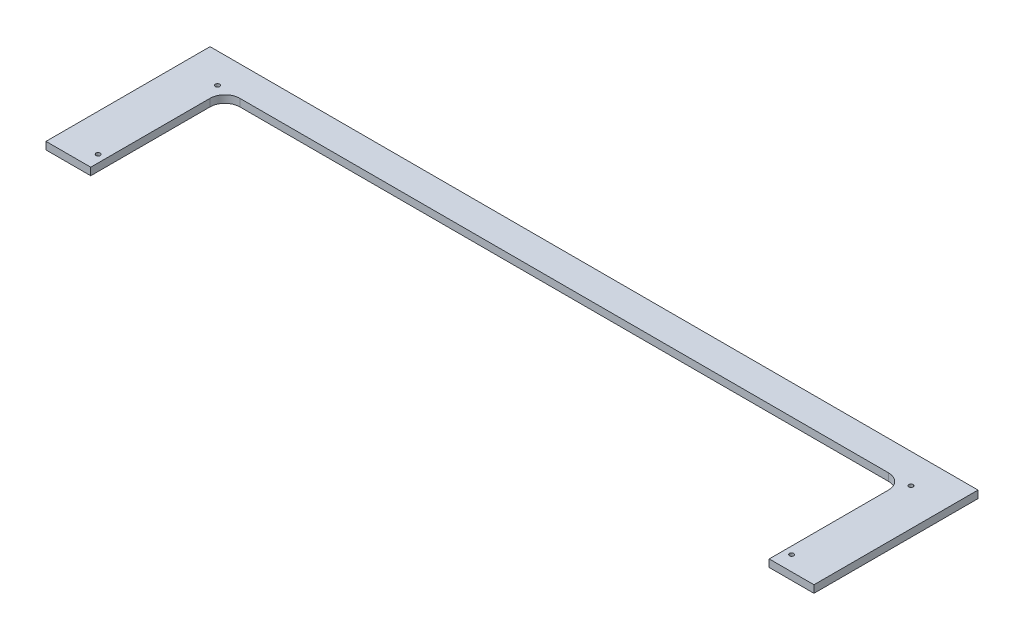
ISO-10303-21;
HEADER;
FILE_DESCRIPTION(('STEP AP214'),'2;1');
FILE_NAME('part.step','',(''),(''),'','','');
FILE_SCHEMA(('AUTOMOTIVE_DESIGN { 1 0 10303 214 1 1 1 1 }'));
ENDSEC;
DATA;
#1=APPLICATION_CONTEXT('core data for automotive mechanical design processes');
#2=APPLICATION_PROTOCOL_DEFINITION('international standard','automotive_design',2000,#1);
#3=PRODUCT_CONTEXT('',#1,'mechanical');
#4=PRODUCT('Part','Part','',(#3));
#5=PRODUCT_RELATED_PRODUCT_CATEGORY('part','',(#4));
#6=PRODUCT_DEFINITION_FORMATION('','',#4);
#7=PRODUCT_DEFINITION_CONTEXT('part definition',#1,'design');
#8=PRODUCT_DEFINITION('design','',#6,#7);
#9=PRODUCT_DEFINITION_SHAPE('','',#8);
#10=(LENGTH_UNIT() NAMED_UNIT(*) SI_UNIT(.MILLI.,.METRE.));
#11=(NAMED_UNIT(*) PLANE_ANGLE_UNIT() SI_UNIT($,.RADIAN.));
#12=(NAMED_UNIT(*) SI_UNIT($,.STERADIAN.) SOLID_ANGLE_UNIT());
#13=UNCERTAINTY_MEASURE_WITH_UNIT(LENGTH_MEASURE(1.E-05),#10,'distance_accuracy_value','');
#14=(GEOMETRIC_REPRESENTATION_CONTEXT(3) GLOBAL_UNCERTAINTY_ASSIGNED_CONTEXT((#13)) GLOBAL_UNIT_ASSIGNED_CONTEXT((#10,
#11,#12)) REPRESENTATION_CONTEXT('',''));
#15=CARTESIAN_POINT('',(0.,0.,0.));
#16=DIRECTION('',(0.,0.,1.));
#17=DIRECTION('',(1.,0.,0.));
#18=AXIS2_PLACEMENT_3D('',#15,#16,#17);
#19=CARTESIAN_POINT('',(-327.025,6.35,69.85));
#20=DIRECTION('',(0.,0.,-1.));
#21=DIRECTION('',(-1.,0.,0.));
#22=AXIS2_PLACEMENT_3D('',#19,#20,#21);
#23=PLANE('',#22);
#24=DIRECTION('',(1.,0.,0.));
#25=VECTOR('',#24,1.);
#26=CARTESIAN_POINT('',(-327.025,0.,69.85));
#27=LINE('',#26,#25);
#28=CARTESIAN_POINT('',(-327.025,0.,69.85));
#29=VERTEX_POINT('',#28);
#30=CARTESIAN_POINT('',(-288.925,0.,69.85));
#31=VERTEX_POINT('',#30);
#32=EDGE_CURVE('E254',#29,#31,#27,.T.);
#33=ORIENTED_EDGE('',*,*,#32,.T.);
#34=DIRECTION('',(0.,1.,0.));
#35=VECTOR('',#34,1.);
#36=CARTESIAN_POINT('',(-288.925,0.,69.85));
#37=LINE('',#36,#35);
#38=CARTESIAN_POINT('',(-288.925,6.35,69.85));
#39=VERTEX_POINT('',#38);
#40=EDGE_CURVE('E231',#31,#39,#37,.T.);
#41=ORIENTED_EDGE('',*,*,#40,.T.);
#42=DIRECTION('',(1.,0.,0.));
#43=VECTOR('',#42,1.);
#44=CARTESIAN_POINT('',(-327.025,6.35,69.85));
#45=LINE('',#44,#43);
#46=CARTESIAN_POINT('',(-327.025,6.35,69.85));
#47=VERTEX_POINT('',#46);
#48=EDGE_CURVE('E89',#47,#39,#45,.T.);
#49=ORIENTED_EDGE('',*,*,#48,.F.);
#50=DIRECTION('',(0.,-1.,0.));
#51=VECTOR('',#50,1.);
#52=CARTESIAN_POINT('',(-327.025,6.35,69.85));
#53=LINE('',#52,#51);
#54=EDGE_CURVE('E11',#47,#29,#53,.T.);
#55=ORIENTED_EDGE('',*,*,#54,.T.);
#56=EDGE_LOOP('',(#33,#41,#49,#55));
#57=FACE_BOUND('',#56,.T.);
#58=ADVANCED_FACE('F37',(#57),#23,.F.);
#59=CARTESIAN_POINT('',(-327.025,6.35,-69.85));
#60=DIRECTION('',(1.,0.,0.));
#61=DIRECTION('',(0.,0.,-1.));
#62=AXIS2_PLACEMENT_3D('',#59,#60,#61);
#63=PLANE('',#62);
#64=DIRECTION('',(0.,0.,1.));
#65=VECTOR('',#64,1.);
#66=CARTESIAN_POINT('',(-327.025,0.,-69.85));
#67=LINE('',#66,#65);
#68=CARTESIAN_POINT('',(-327.025,0.,-69.85));
#69=VERTEX_POINT('',#68);
#70=EDGE_CURVE('E233',#69,#29,#67,.T.);
#71=ORIENTED_EDGE('',*,*,#70,.T.);
#72=ORIENTED_EDGE('',*,*,#54,.F.);
#73=DIRECTION('',(0.,0.,1.));
#74=VECTOR('',#73,1.);
#75=CARTESIAN_POINT('',(-327.025,6.35,-69.85));
#76=LINE('',#75,#74);
#77=CARTESIAN_POINT('',(-327.025,6.35,-69.85));
#78=VERTEX_POINT('',#77);
#79=EDGE_CURVE('E243',#78,#47,#76,.T.);
#80=ORIENTED_EDGE('',*,*,#79,.F.);
#81=DIRECTION('',(0.,-1.,0.));
#82=VECTOR('',#81,1.);
#83=CARTESIAN_POINT('',(-327.025,6.35,-69.85));
#84=LINE('',#83,#82);
#85=EDGE_CURVE('E250',#78,#69,#84,.T.);
#86=ORIENTED_EDGE('',*,*,#85,.T.);
#87=EDGE_LOOP('',(#71,#72,#80,#86));
#88=FACE_BOUND('',#87,.T.);
#89=ADVANCED_FACE('F39',(#88),#63,.F.);
#90=CARTESIAN_POINT('',(288.925,6.35,69.85));
#91=VERTEX_POINT('',#90);
#92=CARTESIAN_POINT('',(327.025,6.35,69.85));
#93=VERTEX_POINT('',#92);
#94=EDGE_CURVE('E245',#91,#93,#45,.T.);
#95=ORIENTED_EDGE('',*,*,#94,.F.);
#96=DIRECTION('',(0.,1.,0.));
#97=VECTOR('',#96,1.);
#98=CARTESIAN_POINT('',(288.925,0.,69.85));
#99=LINE('',#98,#97);
#100=CARTESIAN_POINT('',(288.925,0.,69.85));
#101=VERTEX_POINT('',#100);
#102=EDGE_CURVE('E218',#101,#91,#99,.T.);
#103=ORIENTED_EDGE('',*,*,#102,.F.);
#104=CARTESIAN_POINT('',(327.025,0.,69.85));
#105=VERTEX_POINT('',#104);
#106=EDGE_CURVE('E253',#101,#105,#27,.T.);
#107=ORIENTED_EDGE('',*,*,#106,.T.);
#108=DIRECTION('',(0.,-1.,0.));
#109=VECTOR('',#108,1.);
#110=CARTESIAN_POINT('',(327.025,6.35,69.85));
#111=LINE('',#110,#109);
#112=EDGE_CURVE('E45',#93,#105,#111,.T.);
#113=ORIENTED_EDGE('',*,*,#112,.F.);
#114=EDGE_LOOP('',(#95,#103,#107,#113));
#115=FACE_BOUND('',#114,.T.);
#116=ADVANCED_FACE('F289',(#115),#23,.F.);
#117=CARTESIAN_POINT('',(327.025,6.35,-69.85));
#118=DIRECTION('',(-1.,0.,0.));
#119=DIRECTION('',(0.,0.,1.));
#120=AXIS2_PLACEMENT_3D('',#117,#118,#119);
#121=PLANE('',#120);
#122=DIRECTION('',(0.,0.,-1.));
#123=VECTOR('',#122,1.);
#124=CARTESIAN_POINT('',(327.025,0.,-69.85));
#125=LINE('',#124,#123);
#126=CARTESIAN_POINT('',(327.025,0.,-69.85));
#127=VERTEX_POINT('',#126);
#128=EDGE_CURVE('E257',#105,#127,#125,.T.);
#129=ORIENTED_EDGE('',*,*,#128,.T.);
#130=DIRECTION('',(0.,-1.,0.));
#131=VECTOR('',#130,1.);
#132=CARTESIAN_POINT('',(327.025,6.35,-69.85));
#133=LINE('',#132,#131);
#134=CARTESIAN_POINT('',(327.025,6.35,-69.85));
#135=VERTEX_POINT('',#134);
#136=EDGE_CURVE('E261',#135,#127,#133,.T.);
#137=ORIENTED_EDGE('',*,*,#136,.F.);
#138=DIRECTION('',(0.,0.,-1.));
#139=VECTOR('',#138,1.);
#140=CARTESIAN_POINT('',(327.025,6.35,-69.85));
#141=LINE('',#140,#139);
#142=EDGE_CURVE('E247',#93,#135,#141,.T.);
#143=ORIENTED_EDGE('',*,*,#142,.F.);
#144=ORIENTED_EDGE('',*,*,#112,.T.);
#145=EDGE_LOOP('',(#129,#137,#143,#144));
#146=FACE_BOUND('',#145,.T.);
#147=ADVANCED_FACE('F267',(#146),#121,.F.);
#148=CARTESIAN_POINT('',(-327.025,6.35,-69.85));
#149=DIRECTION('',(0.,0.,1.));
#150=DIRECTION('',(1.,0.,0.));
#151=AXIS2_PLACEMENT_3D('',#148,#149,#150);
#152=PLANE('',#151);
#153=CARTESIAN_POINT('',(295.275,3.17500000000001,-69.85));
#154=DIRECTION('',(0.,0.,-1.));
#155=DIRECTION('',(-1.,0.,0.));
#156=AXIS2_PLACEMENT_3D('',#153,#154,#155);
#157=CIRCLE('',#156,1.35255000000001);
#158=CARTESIAN_POINT('',(293.92245,3.17500000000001,-69.85));
#159=VERTEX_POINT('',#158);
#160=EDGE_CURVE('E145',#159,#159,#157,.T.);
#161=ORIENTED_EDGE('',*,*,#160,.F.);
#162=EDGE_LOOP('',(#161));
#163=FACE_BOUND('',#162,.T.);
#164=CARTESIAN_POINT('',(98.425,3.17500000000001,-69.85));
#165=DIRECTION('',(0.,0.,-1.));
#166=DIRECTION('',(-1.,0.,0.));
#167=AXIS2_PLACEMENT_3D('',#164,#165,#166);
#168=CIRCLE('',#167,1.35254999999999);
#169=CARTESIAN_POINT('',(97.07245,3.17500000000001,-69.85));
#170=VERTEX_POINT('',#169);
#171=EDGE_CURVE('E144',#170,#170,#168,.T.);
#172=ORIENTED_EDGE('',*,*,#171,.F.);
#173=EDGE_LOOP('',(#172));
#174=FACE_BOUND('',#173,.T.);
#175=CARTESIAN_POINT('',(-98.425,3.17500000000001,-69.85));
#176=DIRECTION('',(0.,0.,-1.));
#177=DIRECTION('',(-1.,0.,0.));
#178=AXIS2_PLACEMENT_3D('',#175,#176,#177);
#179=CIRCLE('',#178,1.35254999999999);
#180=CARTESIAN_POINT('',(-99.77755,3.17500000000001,-69.85));
#181=VERTEX_POINT('',#180);
#182=EDGE_CURVE('E155',#181,#181,#179,.T.);
#183=ORIENTED_EDGE('',*,*,#182,.F.);
#184=EDGE_LOOP('',(#183));
#185=FACE_BOUND('',#184,.T.);
#186=CARTESIAN_POINT('',(-295.275,3.17500000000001,-69.85));
#187=DIRECTION('',(0.,0.,-1.));
#188=DIRECTION('',(-1.,0.,0.));
#189=AXIS2_PLACEMENT_3D('',#186,#187,#188);
#190=CIRCLE('',#189,1.35255000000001);
#191=CARTESIAN_POINT('',(-296.62755,3.17500000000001,-69.85));
#192=VERTEX_POINT('',#191);
#193=EDGE_CURVE('E161',#192,#192,#190,.T.);
#194=ORIENTED_EDGE('',*,*,#193,.F.);
#195=EDGE_LOOP('',(#194));
#196=FACE_BOUND('',#195,.T.);
#197=DIRECTION('',(-1.,0.,0.));
#198=VECTOR('',#197,1.);
#199=CARTESIAN_POINT('',(-327.025,0.,-69.85));
#200=LINE('',#199,#198);
#201=EDGE_CURVE('E82',#127,#69,#200,.T.);
#202=ORIENTED_EDGE('',*,*,#201,.T.);
#203=ORIENTED_EDGE('',*,*,#85,.F.);
#204=DIRECTION('',(-1.,0.,0.));
#205=VECTOR('',#204,1.);
#206=CARTESIAN_POINT('',(-327.025,6.35,-69.85));
#207=LINE('',#206,#205);
#208=EDGE_CURVE('E61',#135,#78,#207,.T.);
#209=ORIENTED_EDGE('',*,*,#208,.F.);
#210=ORIENTED_EDGE('',*,*,#136,.T.);
#211=EDGE_LOOP('',(#202,#203,#209,#210));
#212=FACE_BOUND('',#211,.T.);
#213=ADVANCED_FACE('F278',(#163,#174,#185,#196,#212),#152,.F.);
#214=CARTESIAN_POINT('',(0.,6.35,0.));
#215=DIRECTION('',(0.,1.,0.));
#216=DIRECTION('',(0.,0.,1.));
#217=AXIS2_PLACEMENT_3D('',#214,#215,#216);
#218=PLANE('',#217);
#219=CARTESIAN_POINT('',(-295.275,6.35,57.15));
#220=DIRECTION('',(0.,-1.,0.));
#221=DIRECTION('',(0.,0.,-1.));
#222=AXIS2_PLACEMENT_3D('',#219,#220,#221);
#223=CIRCLE('',#222,1.82880000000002);
#224=CARTESIAN_POINT('',(-295.275,6.35,55.3212));
#225=VERTEX_POINT('',#224);
#226=EDGE_CURVE('E173',#225,#225,#223,.T.);
#227=ORIENTED_EDGE('',*,*,#226,.T.);
#228=EDGE_LOOP('',(#227));
#229=FACE_BOUND('',#228,.T.);
#230=CARTESIAN_POINT('',(-295.275,6.35,-44.45));
#231=DIRECTION('',(0.,-1.,0.));
#232=DIRECTION('',(0.,0.,-1.));
#233=AXIS2_PLACEMENT_3D('',#230,#231,#232);
#234=CIRCLE('',#233,1.82880000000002);
#235=CARTESIAN_POINT('',(-295.275,6.35,-46.2788));
#236=VERTEX_POINT('',#235);
#237=EDGE_CURVE('E182',#236,#236,#234,.T.);
#238=ORIENTED_EDGE('',*,*,#237,.T.);
#239=EDGE_LOOP('',(#238));
#240=FACE_BOUND('',#239,.T.);
#241=CARTESIAN_POINT('',(295.275,6.35,-44.4499999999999));
#242=DIRECTION('',(0.,-1.,0.));
#243=DIRECTION('',(0.,0.,-1.));
#244=AXIS2_PLACEMENT_3D('',#241,#242,#243);
#245=CIRCLE('',#244,1.82880000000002);
#246=CARTESIAN_POINT('',(295.275,6.35,-46.2787999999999));
#247=VERTEX_POINT('',#246);
#248=EDGE_CURVE('E191',#247,#247,#245,.T.);
#249=ORIENTED_EDGE('',*,*,#248,.T.);
#250=EDGE_LOOP('',(#249));
#251=FACE_BOUND('',#250,.T.);
#252=CARTESIAN_POINT('',(295.275,6.35,57.1500000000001));
#253=DIRECTION('',(0.,-1.,0.));
#254=DIRECTION('',(0.,0.,-1.));
#255=AXIS2_PLACEMENT_3D('',#252,#253,#254);
#256=CIRCLE('',#255,1.82880000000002);
#257=CARTESIAN_POINT('',(295.275,6.35,55.3212000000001));
#258=VERTEX_POINT('',#257);
#259=EDGE_CURVE('E200',#258,#258,#256,.T.);
#260=ORIENTED_EDGE('',*,*,#259,.T.);
#261=EDGE_LOOP('',(#260));
#262=FACE_BOUND('',#261,.T.);
#263=DIRECTION('',(0.,0.,1.));
#264=VECTOR('',#263,1.);
#265=CARTESIAN_POINT('',(-288.925,6.35,69.85));
#266=LINE('',#265,#264);
#267=CARTESIAN_POINT('',(-288.925,6.35,-31.75));
#268=VERTEX_POINT('',#267);
#269=EDGE_CURVE('E207',#268,#39,#266,.T.);
#270=ORIENTED_EDGE('',*,*,#269,.F.);
#271=CARTESIAN_POINT('',(-276.225,6.35,-31.75));
#272=DIRECTION('',(0.,1.,0.));
#273=DIRECTION('',(0.,0.,1.));
#274=AXIS2_PLACEMENT_3D('',#271,#272,#273);
#275=CIRCLE('',#274,12.7);
#276=CARTESIAN_POINT('',(-276.225,6.35,-44.45));
#277=VERTEX_POINT('',#276);
#278=EDGE_CURVE('E227',#277,#268,#275,.T.);
#279=ORIENTED_EDGE('',*,*,#278,.F.);
#280=DIRECTION('',(-1.,0.,0.));
#281=VECTOR('',#280,1.);
#282=CARTESIAN_POINT('',(-276.225,6.35,-44.45));
#283=LINE('',#282,#281);
#284=CARTESIAN_POINT('',(276.225,6.35,-44.45));
#285=VERTEX_POINT('',#284);
#286=EDGE_CURVE('E224',#285,#277,#283,.T.);
#287=ORIENTED_EDGE('',*,*,#286,.F.);
#288=CARTESIAN_POINT('',(276.225,6.35,-31.75));
#289=DIRECTION('',(0.,1.,0.));
#290=DIRECTION('',(0.,0.,1.));
#291=AXIS2_PLACEMENT_3D('',#288,#289,#290);
#292=CIRCLE('',#291,12.7);
#293=CARTESIAN_POINT('',(288.925,6.35,-31.75));
#294=VERTEX_POINT('',#293);
#295=EDGE_CURVE('E221',#294,#285,#292,.T.);
#296=ORIENTED_EDGE('',*,*,#295,.F.);
#297=DIRECTION('',(0.,0.,-1.));
#298=VECTOR('',#297,1.);
#299=CARTESIAN_POINT('',(288.925,6.35,-31.75));
#300=LINE('',#299,#298);
#301=EDGE_CURVE('E203',#91,#294,#300,.T.);
#302=ORIENTED_EDGE('',*,*,#301,.F.);
#303=ORIENTED_EDGE('',*,*,#94,.T.);
#304=ORIENTED_EDGE('',*,*,#142,.T.);
#305=ORIENTED_EDGE('',*,*,#208,.T.);
#306=ORIENTED_EDGE('',*,*,#79,.T.);
#307=ORIENTED_EDGE('',*,*,#48,.T.);
#308=EDGE_LOOP('',(#270,#279,#287,#296,#302,#303,#304,#305,#306,#307));
#309=FACE_BOUND('',#308,.T.);
#310=ADVANCED_FACE('F280',(#229,#240,#251,#262,#309),#218,.T.);
#311=CARTESIAN_POINT('',(0.,0.,0.));
#312=DIRECTION('',(0.,1.,0.));
#313=DIRECTION('',(0.,0.,1.));
#314=AXIS2_PLACEMENT_3D('',#311,#312,#313);
#315=PLANE('',#314);
#316=CARTESIAN_POINT('',(-295.275,0.,57.15));
#317=DIRECTION('',(0.,-1.,0.));
#318=DIRECTION('',(0.,0.,-1.));
#319=AXIS2_PLACEMENT_3D('',#316,#317,#318);
#320=CIRCLE('',#319,3.89889999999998);
#321=CARTESIAN_POINT('',(-295.275,0.,53.2511000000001));
#322=VERTEX_POINT('',#321);
#323=EDGE_CURVE('E167',#322,#322,#320,.T.);
#324=ORIENTED_EDGE('',*,*,#323,.F.);
#325=EDGE_LOOP('',(#324));
#326=FACE_BOUND('',#325,.T.);
#327=CARTESIAN_POINT('',(-295.275,0.,-44.45));
#328=DIRECTION('',(0.,-1.,0.));
#329=DIRECTION('',(0.,0.,-1.));
#330=AXIS2_PLACEMENT_3D('',#327,#328,#329);
#331=CIRCLE('',#330,3.89889999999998);
#332=CARTESIAN_POINT('',(-295.275,0.,-48.3488999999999));
#333=VERTEX_POINT('',#332);
#334=EDGE_CURVE('E176',#333,#333,#331,.T.);
#335=ORIENTED_EDGE('',*,*,#334,.F.);
#336=EDGE_LOOP('',(#335));
#337=FACE_BOUND('',#336,.T.);
#338=CARTESIAN_POINT('',(295.275,0.,-44.4499999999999));
#339=DIRECTION('',(0.,-1.,0.));
#340=DIRECTION('',(0.,0.,-1.));
#341=AXIS2_PLACEMENT_3D('',#338,#339,#340);
#342=CIRCLE('',#341,3.89889999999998);
#343=CARTESIAN_POINT('',(295.275,0.,-48.3488999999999));
#344=VERTEX_POINT('',#343);
#345=EDGE_CURVE('E185',#344,#344,#342,.T.);
#346=ORIENTED_EDGE('',*,*,#345,.F.);
#347=EDGE_LOOP('',(#346));
#348=FACE_BOUND('',#347,.T.);
#349=CARTESIAN_POINT('',(295.275,0.,57.1500000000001));
#350=DIRECTION('',(0.,-1.,0.));
#351=DIRECTION('',(0.,0.,-1.));
#352=AXIS2_PLACEMENT_3D('',#349,#350,#351);
#353=CIRCLE('',#352,3.89889999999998);
#354=CARTESIAN_POINT('',(295.275,0.,53.2511000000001));
#355=VERTEX_POINT('',#354);
#356=EDGE_CURVE('E194',#355,#355,#353,.T.);
#357=ORIENTED_EDGE('',*,*,#356,.F.);
#358=EDGE_LOOP('',(#357));
#359=FACE_BOUND('',#358,.T.);
#360=CARTESIAN_POINT('',(-276.225,0.,-31.75));
#361=DIRECTION('',(0.,1.,0.));
#362=DIRECTION('',(0.,0.,1.));
#363=AXIS2_PLACEMENT_3D('',#360,#361,#362);
#364=CIRCLE('',#363,12.7);
#365=CARTESIAN_POINT('',(-276.225,0.,-44.45));
#366=VERTEX_POINT('',#365);
#367=CARTESIAN_POINT('',(-288.925,0.,-31.75));
#368=VERTEX_POINT('',#367);
#369=EDGE_CURVE('E212',#366,#368,#364,.T.);
#370=ORIENTED_EDGE('',*,*,#369,.T.);
#371=DIRECTION('',(0.,0.,1.));
#372=VECTOR('',#371,1.);
#373=CARTESIAN_POINT('',(-288.925,0.,69.85));
#374=LINE('',#373,#372);
#375=EDGE_CURVE('E215',#368,#31,#374,.T.);
#376=ORIENTED_EDGE('',*,*,#375,.T.);
#377=ORIENTED_EDGE('',*,*,#32,.F.);
#378=ORIENTED_EDGE('',*,*,#70,.F.);
#379=ORIENTED_EDGE('',*,*,#201,.F.);
#380=ORIENTED_EDGE('',*,*,#128,.F.);
#381=ORIENTED_EDGE('',*,*,#106,.F.);
#382=DIRECTION('',(0.,0.,-1.));
#383=VECTOR('',#382,1.);
#384=CARTESIAN_POINT('',(288.925,0.,-31.75));
#385=LINE('',#384,#383);
#386=CARTESIAN_POINT('',(288.925,0.,-31.75));
#387=VERTEX_POINT('',#386);
#388=EDGE_CURVE('E204',#101,#387,#385,.T.);
#389=ORIENTED_EDGE('',*,*,#388,.T.);
#390=CARTESIAN_POINT('',(276.225,0.,-31.75));
#391=DIRECTION('',(0.,1.,0.));
#392=DIRECTION('',(0.,0.,1.));
#393=AXIS2_PLACEMENT_3D('',#390,#391,#392);
#394=CIRCLE('',#393,12.7);
#395=CARTESIAN_POINT('',(276.225,0.,-44.45));
#396=VERTEX_POINT('',#395);
#397=EDGE_CURVE('E52',#387,#396,#394,.T.);
#398=ORIENTED_EDGE('',*,*,#397,.T.);
#399=DIRECTION('',(-1.,0.,0.));
#400=VECTOR('',#399,1.);
#401=CARTESIAN_POINT('',(-276.225,0.,-44.45));
#402=LINE('',#401,#400);
#403=EDGE_CURVE('E209',#396,#366,#402,.T.);
#404=ORIENTED_EDGE('',*,*,#403,.T.);
#405=EDGE_LOOP('',(#370,#376,#377,#378,#379,#380,#381,#389,#398,#404));
#406=FACE_BOUND('',#405,.T.);
#407=ADVANCED_FACE('F273',(#326,#337,#348,#359,#406),#315,.F.);
#408=CARTESIAN_POINT('',(-288.925,0.,69.85));
#409=DIRECTION('',(-1.,0.,0.));
#410=DIRECTION('',(0.,0.,1.));
#411=AXIS2_PLACEMENT_3D('',#408,#409,#410);
#412=PLANE('',#411);
#413=ORIENTED_EDGE('',*,*,#269,.T.);
#414=ORIENTED_EDGE('',*,*,#40,.F.);
#415=ORIENTED_EDGE('',*,*,#375,.F.);
#416=DIRECTION('',(0.,1.,0.));
#417=VECTOR('',#416,1.);
#418=CARTESIAN_POINT('',(-288.925,0.,-31.75));
#419=LINE('',#418,#417);
#420=EDGE_CURVE('E234',#368,#268,#419,.T.);
#421=ORIENTED_EDGE('',*,*,#420,.T.);
#422=EDGE_LOOP('',(#413,#414,#415,#421));
#423=FACE_BOUND('',#422,.T.);
#424=ADVANCED_FACE('F317',(#423),#412,.F.);
#425=CARTESIAN_POINT('',(-276.225,0.,-31.75));
#426=DIRECTION('',(0.,1.,0.));
#427=DIRECTION('',(0.,0.,1.));
#428=AXIS2_PLACEMENT_3D('',#425,#426,#427);
#429=CYLINDRICAL_SURFACE('',#428,12.7);
#430=ORIENTED_EDGE('',*,*,#278,.T.);
#431=ORIENTED_EDGE('',*,*,#420,.F.);
#432=ORIENTED_EDGE('',*,*,#369,.F.);
#433=DIRECTION('',(0.,1.,0.));
#434=VECTOR('',#433,1.);
#435=CARTESIAN_POINT('',(-276.225,0.,-44.45));
#436=LINE('',#435,#434);
#437=EDGE_CURVE('E236',#366,#277,#436,.T.);
#438=ORIENTED_EDGE('',*,*,#437,.T.);
#439=EDGE_LOOP('',(#430,#431,#432,#438));
#440=FACE_BOUND('',#439,.T.);
#441=ADVANCED_FACE('F314',(#440),#429,.F.);
#442=CARTESIAN_POINT('',(-276.225,0.,-44.45));
#443=DIRECTION('',(0.,0.,-1.));
#444=DIRECTION('',(-1.,0.,0.));
#445=AXIS2_PLACEMENT_3D('',#442,#443,#444);
#446=PLANE('',#445);
#447=ORIENTED_EDGE('',*,*,#286,.T.);
#448=ORIENTED_EDGE('',*,*,#437,.F.);
#449=ORIENTED_EDGE('',*,*,#403,.F.);
#450=DIRECTION('',(0.,1.,0.));
#451=VECTOR('',#450,1.);
#452=CARTESIAN_POINT('',(276.225,0.,-44.45));
#453=LINE('',#452,#451);
#454=EDGE_CURVE('E238',#396,#285,#453,.T.);
#455=ORIENTED_EDGE('',*,*,#454,.T.);
#456=EDGE_LOOP('',(#447,#448,#449,#455));
#457=FACE_BOUND('',#456,.T.);
#458=ADVANCED_FACE('F311',(#457),#446,.F.);
#459=CARTESIAN_POINT('',(276.225,0.,-31.75));
#460=DIRECTION('',(0.,1.,0.));
#461=DIRECTION('',(0.,0.,1.));
#462=AXIS2_PLACEMENT_3D('',#459,#460,#461);
#463=CYLINDRICAL_SURFACE('',#462,12.7);
#464=ORIENTED_EDGE('',*,*,#295,.T.);
#465=ORIENTED_EDGE('',*,*,#454,.F.);
#466=ORIENTED_EDGE('',*,*,#397,.F.);
#467=DIRECTION('',(0.,1.,0.));
#468=VECTOR('',#467,1.);
#469=CARTESIAN_POINT('',(288.925,0.,-31.75));
#470=LINE('',#469,#468);
#471=EDGE_CURVE('E240',#387,#294,#470,.T.);
#472=ORIENTED_EDGE('',*,*,#471,.T.);
#473=EDGE_LOOP('',(#464,#465,#466,#472));
#474=FACE_BOUND('',#473,.T.);
#475=ADVANCED_FACE('F332',(#474),#463,.F.);
#476=CARTESIAN_POINT('',(288.925,0.,-31.75));
#477=DIRECTION('',(1.,0.,0.));
#478=DIRECTION('',(0.,0.,-1.));
#479=AXIS2_PLACEMENT_3D('',#476,#477,#478);
#480=PLANE('',#479);
#481=ORIENTED_EDGE('',*,*,#301,.T.);
#482=ORIENTED_EDGE('',*,*,#471,.F.);
#483=ORIENTED_EDGE('',*,*,#388,.F.);
#484=ORIENTED_EDGE('',*,*,#102,.T.);
#485=EDGE_LOOP('',(#481,#482,#483,#484));
#486=FACE_BOUND('',#485,.T.);
#487=ADVANCED_FACE('F307',(#486),#480,.F.);
#488=CARTESIAN_POINT('',(295.275,0.,57.1500000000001));
#489=DIRECTION('',(0.,-1.,0.));
#490=DIRECTION('',(0.,0.,-1.));
#491=AXIS2_PLACEMENT_3D('',#488,#489,#490);
#492=CYLINDRICAL_SURFACE('',#491,1.82880000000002);
#493=ORIENTED_EDGE('',*,*,#259,.F.);
#494=EDGE_LOOP('',(#493));
#495=FACE_BOUND('',#494,.T.);
#496=CARTESIAN_POINT('',(295.275,2.38137763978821,57.1500000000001));
#497=DIRECTION('',(0.,-1.,0.));
#498=DIRECTION('',(0.,0.,-1.));
#499=AXIS2_PLACEMENT_3D('',#496,#497,#498);
#500=CIRCLE('',#499,1.82880000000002);
#501=CARTESIAN_POINT('',(295.275,2.38137763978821,55.3212000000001));
#502=VERTEX_POINT('',#501);
#503=EDGE_CURVE('E197',#502,#502,#500,.T.);
#504=ORIENTED_EDGE('',*,*,#503,.T.);
#505=EDGE_LOOP('',(#504));
#506=FACE_BOUND('',#505,.T.);
#507=ADVANCED_FACE('F327',(#495,#506),#492,.F.);
#508=CARTESIAN_POINT('',(295.275,0.,57.1500000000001));
#509=DIRECTION('',(0.,-1.,0.));
#510=DIRECTION('',(0.,0.,-1.));
#511=AXIS2_PLACEMENT_3D('',#508,#509,#510);
#512=CONICAL_SURFACE('',#511,3.89889999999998,0.715584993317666);
#513=ORIENTED_EDGE('',*,*,#503,.F.);
#514=EDGE_LOOP('',(#513));
#515=FACE_BOUND('',#514,.T.);
#516=ORIENTED_EDGE('',*,*,#356,.T.);
#517=EDGE_LOOP('',(#516));
#518=FACE_BOUND('',#517,.T.);
#519=ADVANCED_FACE('F339',(#515,#518),#512,.F.);
#520=CARTESIAN_POINT('',(295.275,0.,-44.4499999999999));
#521=DIRECTION('',(0.,-1.,0.));
#522=DIRECTION('',(0.,0.,-1.));
#523=AXIS2_PLACEMENT_3D('',#520,#521,#522);
#524=CYLINDRICAL_SURFACE('',#523,1.82880000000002);
#525=ORIENTED_EDGE('',*,*,#248,.F.);
#526=EDGE_LOOP('',(#525));
#527=FACE_BOUND('',#526,.T.);
#528=CARTESIAN_POINT('',(295.275,2.38137763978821,-44.4499999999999));
#529=DIRECTION('',(0.,-1.,0.));
#530=DIRECTION('',(0.,0.,-1.));
#531=AXIS2_PLACEMENT_3D('',#528,#529,#530);
#532=CIRCLE('',#531,1.82880000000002);
#533=CARTESIAN_POINT('',(295.275,2.38137763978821,-46.2787999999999));
#534=VERTEX_POINT('',#533);
#535=EDGE_CURVE('E188',#534,#534,#532,.T.);
#536=ORIENTED_EDGE('',*,*,#535,.T.);
#537=EDGE_LOOP('',(#536));
#538=FACE_BOUND('',#537,.T.);
#539=ADVANCED_FACE('F344',(#527,#538),#524,.F.);
#540=CARTESIAN_POINT('',(295.275,0.,-44.4499999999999));
#541=DIRECTION('',(0.,-1.,0.));
#542=DIRECTION('',(0.,0.,-1.));
#543=AXIS2_PLACEMENT_3D('',#540,#541,#542);
#544=CONICAL_SURFACE('',#543,3.89889999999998,0.715584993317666);
#545=ORIENTED_EDGE('',*,*,#535,.F.);
#546=EDGE_LOOP('',(#545));
#547=FACE_BOUND('',#546,.T.);
#548=ORIENTED_EDGE('',*,*,#345,.T.);
#549=EDGE_LOOP('',(#548));
#550=FACE_BOUND('',#549,.T.);
#551=ADVANCED_FACE('F356',(#547,#550),#544,.F.);
#552=CARTESIAN_POINT('',(-295.275,0.,-44.45));
#553=DIRECTION('',(0.,-1.,0.));
#554=DIRECTION('',(0.,0.,-1.));
#555=AXIS2_PLACEMENT_3D('',#552,#553,#554);
#556=CYLINDRICAL_SURFACE('',#555,1.82880000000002);
#557=ORIENTED_EDGE('',*,*,#237,.F.);
#558=EDGE_LOOP('',(#557));
#559=FACE_BOUND('',#558,.T.);
#560=CARTESIAN_POINT('',(-295.275,2.38137763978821,-44.45));
#561=DIRECTION('',(0.,-1.,0.));
#562=DIRECTION('',(0.,0.,-1.));
#563=AXIS2_PLACEMENT_3D('',#560,#561,#562);
#564=CIRCLE('',#563,1.82880000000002);
#565=CARTESIAN_POINT('',(-295.275,2.38137763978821,-46.2788));
#566=VERTEX_POINT('',#565);
#567=EDGE_CURVE('E179',#566,#566,#564,.T.);
#568=ORIENTED_EDGE('',*,*,#567,.T.);
#569=EDGE_LOOP('',(#568));
#570=FACE_BOUND('',#569,.T.);
#571=ADVANCED_FACE('F362',(#559,#570),#556,.F.);
#572=CARTESIAN_POINT('',(-295.275,0.,-44.45));
#573=DIRECTION('',(0.,-1.,0.));
#574=DIRECTION('',(0.,0.,-1.));
#575=AXIS2_PLACEMENT_3D('',#572,#573,#574);
#576=CONICAL_SURFACE('',#575,3.89889999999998,0.715584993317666);
#577=ORIENTED_EDGE('',*,*,#567,.F.);
#578=EDGE_LOOP('',(#577));
#579=FACE_BOUND('',#578,.T.);
#580=ORIENTED_EDGE('',*,*,#334,.T.);
#581=EDGE_LOOP('',(#580));
#582=FACE_BOUND('',#581,.T.);
#583=ADVANCED_FACE('F366',(#579,#582),#576,.F.);
#584=CARTESIAN_POINT('',(-295.275,0.,57.15));
#585=DIRECTION('',(0.,-1.,0.));
#586=DIRECTION('',(0.,0.,-1.));
#587=AXIS2_PLACEMENT_3D('',#584,#585,#586);
#588=CYLINDRICAL_SURFACE('',#587,1.82880000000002);
#589=ORIENTED_EDGE('',*,*,#226,.F.);
#590=EDGE_LOOP('',(#589));
#591=FACE_BOUND('',#590,.T.);
#592=CARTESIAN_POINT('',(-295.275,2.38137763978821,57.15));
#593=DIRECTION('',(0.,-1.,0.));
#594=DIRECTION('',(0.,0.,-1.));
#595=AXIS2_PLACEMENT_3D('',#592,#593,#594);
#596=CIRCLE('',#595,1.82880000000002);
#597=CARTESIAN_POINT('',(-295.275,2.38137763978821,55.3212));
#598=VERTEX_POINT('',#597);
#599=EDGE_CURVE('E170',#598,#598,#596,.T.);
#600=ORIENTED_EDGE('',*,*,#599,.T.);
#601=EDGE_LOOP('',(#600));
#602=FACE_BOUND('',#601,.T.);
#603=ADVANCED_FACE('F370',(#591,#602),#588,.F.);
#604=CARTESIAN_POINT('',(-295.275,0.,57.15));
#605=DIRECTION('',(0.,-1.,0.));
#606=DIRECTION('',(0.,0.,-1.));
#607=AXIS2_PLACEMENT_3D('',#604,#605,#606);
#608=CONICAL_SURFACE('',#607,3.89889999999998,0.715584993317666);
#609=ORIENTED_EDGE('',*,*,#599,.F.);
#610=EDGE_LOOP('',(#609));
#611=FACE_BOUND('',#610,.T.);
#612=ORIENTED_EDGE('',*,*,#323,.T.);
#613=EDGE_LOOP('',(#612));
#614=FACE_BOUND('',#613,.T.);
#615=ADVANCED_FACE('F374',(#611,#614),#608,.F.);
#616=CARTESIAN_POINT('',(-295.275,3.17500000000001,-58.8772));
#617=DIRECTION('',(0.,0.,-1.));
#618=DIRECTION('',(-1.,0.,0.));
#619=AXIS2_PLACEMENT_3D('',#616,#617,#618);
#620=CONICAL_SURFACE('',#619,1.35255000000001,1.02974425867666);
#621=CARTESIAN_POINT('',(-295.275,3.17500000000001,-58.0645059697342));
#622=VERTEX_POINT('',#621);
#623=VERTEX_LOOP('',#622);
#624=FACE_BOUND('',#623,.T.);
#625=CARTESIAN_POINT('',(-295.275,3.17500000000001,-58.8772));
#626=DIRECTION('',(0.,0.,-1.));
#627=DIRECTION('',(-1.,0.,0.));
#628=AXIS2_PLACEMENT_3D('',#625,#626,#627);
#629=CIRCLE('',#628,1.35255000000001);
#630=CARTESIAN_POINT('',(-296.62755,3.17500000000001,-58.8772));
#631=VERTEX_POINT('',#630);
#632=EDGE_CURVE('E164',#631,#631,#629,.T.);
#633=ORIENTED_EDGE('',*,*,#632,.T.);
#634=EDGE_LOOP('',(#633));
#635=FACE_BOUND('',#634,.T.);
#636=ADVANCED_FACE('F378',(#624,#635),#620,.F.);
#637=CARTESIAN_POINT('',(-295.275,3.17500000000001,-69.85));
#638=DIRECTION('',(0.,0.,-1.));
#639=DIRECTION('',(-1.,0.,0.));
#640=AXIS2_PLACEMENT_3D('',#637,#638,#639);
#641=CYLINDRICAL_SURFACE('',#640,1.35255000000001);
#642=ORIENTED_EDGE('',*,*,#632,.F.);
#643=EDGE_LOOP('',(#642));
#644=FACE_BOUND('',#643,.T.);
#645=ORIENTED_EDGE('',*,*,#193,.T.);
#646=EDGE_LOOP('',(#645));
#647=FACE_BOUND('',#646,.T.);
#648=ADVANCED_FACE('F382',(#644,#647),#641,.F.);
#649=CARTESIAN_POINT('',(-98.425,3.17500000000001,-58.8772));
#650=DIRECTION('',(0.,0.,-1.));
#651=DIRECTION('',(-1.,0.,0.));
#652=AXIS2_PLACEMENT_3D('',#649,#650,#651);
#653=CONICAL_SURFACE('',#652,1.35254999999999,1.02974425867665);
#654=CARTESIAN_POINT('',(-98.425,3.17500000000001,-58.0645059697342));
#655=VERTEX_POINT('',#654);
#656=VERTEX_LOOP('',#655);
#657=FACE_BOUND('',#656,.T.);
#658=CARTESIAN_POINT('',(-98.425,3.17500000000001,-58.8772));
#659=DIRECTION('',(0.,0.,-1.));
#660=DIRECTION('',(-1.,0.,0.));
#661=AXIS2_PLACEMENT_3D('',#658,#659,#660);
#662=CIRCLE('',#661,1.35254999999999);
#663=CARTESIAN_POINT('',(-99.77755,3.17500000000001,-58.8772));
#664=VERTEX_POINT('',#663);
#665=EDGE_CURVE('E158',#664,#664,#662,.T.);
#666=ORIENTED_EDGE('',*,*,#665,.T.);
#667=EDGE_LOOP('',(#666));
#668=FACE_BOUND('',#667,.T.);
#669=ADVANCED_FACE('F386',(#657,#668),#653,.F.);
#670=CARTESIAN_POINT('',(-98.425,3.17500000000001,-69.85));
#671=DIRECTION('',(0.,0.,-1.));
#672=DIRECTION('',(-1.,0.,0.));
#673=AXIS2_PLACEMENT_3D('',#670,#671,#672);
#674=CYLINDRICAL_SURFACE('',#673,1.35254999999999);
#675=ORIENTED_EDGE('',*,*,#665,.F.);
#676=EDGE_LOOP('',(#675));
#677=FACE_BOUND('',#676,.T.);
#678=ORIENTED_EDGE('',*,*,#182,.T.);
#679=EDGE_LOOP('',(#678));
#680=FACE_BOUND('',#679,.T.);
#681=ADVANCED_FACE('F390',(#677,#680),#674,.F.);
#682=CARTESIAN_POINT('',(98.425,3.17500000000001,-58.8772));
#683=DIRECTION('',(0.,0.,-1.));
#684=DIRECTION('',(-1.,0.,0.));
#685=AXIS2_PLACEMENT_3D('',#682,#683,#684);
#686=CONICAL_SURFACE('',#685,1.35254999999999,1.02974425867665);
#687=CARTESIAN_POINT('',(98.425,3.17500000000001,-58.0645059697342));
#688=VERTEX_POINT('',#687);
#689=VERTEX_LOOP('',#688);
#690=FACE_BOUND('',#689,.T.);
#691=CARTESIAN_POINT('',(98.425,3.17500000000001,-58.8772));
#692=DIRECTION('',(0.,0.,-1.));
#693=DIRECTION('',(-1.,0.,0.));
#694=AXIS2_PLACEMENT_3D('',#691,#692,#693);
#695=CIRCLE('',#694,1.35254999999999);
#696=CARTESIAN_POINT('',(97.07245,3.17500000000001,-58.8772));
#697=VERTEX_POINT('',#696);
#698=EDGE_CURVE('E148',#697,#697,#695,.T.);
#699=ORIENTED_EDGE('',*,*,#698,.T.);
#700=EDGE_LOOP('',(#699));
#701=FACE_BOUND('',#700,.T.);
#702=ADVANCED_FACE('F394',(#690,#701),#686,.F.);
#703=CARTESIAN_POINT('',(98.425,3.17500000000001,-69.85));
#704=DIRECTION('',(0.,0.,-1.));
#705=DIRECTION('',(-1.,0.,0.));
#706=AXIS2_PLACEMENT_3D('',#703,#704,#705);
#707=CYLINDRICAL_SURFACE('',#706,1.35254999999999);
#708=ORIENTED_EDGE('',*,*,#698,.F.);
#709=EDGE_LOOP('',(#708));
#710=FACE_BOUND('',#709,.T.);
#711=ORIENTED_EDGE('',*,*,#171,.T.);
#712=EDGE_LOOP('',(#711));
#713=FACE_BOUND('',#712,.T.);
#714=ADVANCED_FACE('F138',(#710,#713),#707,.F.);
#715=CARTESIAN_POINT('',(295.275,3.17500000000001,-58.8772));
#716=DIRECTION('',(0.,0.,-1.));
#717=DIRECTION('',(-1.,0.,0.));
#718=AXIS2_PLACEMENT_3D('',#715,#716,#717);
#719=CONICAL_SURFACE('',#718,1.35255000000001,1.02974425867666);
#720=CARTESIAN_POINT('',(295.275,3.17500000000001,-58.0645059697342));
#721=VERTEX_POINT('',#720);
#722=VERTEX_LOOP('',#721);
#723=FACE_BOUND('',#722,.T.);
#724=CARTESIAN_POINT('',(295.275,3.17500000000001,-58.8772));
#725=DIRECTION('',(0.,0.,-1.));
#726=DIRECTION('',(-1.,0.,0.));
#727=AXIS2_PLACEMENT_3D('',#724,#725,#726);
#728=CIRCLE('',#727,1.35255000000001);
#729=CARTESIAN_POINT('',(293.92245,3.17500000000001,-58.8772));
#730=VERTEX_POINT('',#729);
#731=EDGE_CURVE('E142',#730,#730,#728,.T.);
#732=ORIENTED_EDGE('',*,*,#731,.T.);
#733=EDGE_LOOP('',(#732));
#734=FACE_BOUND('',#733,.T.);
#735=ADVANCED_FACE('F134',(#723,#734),#719,.F.);
#736=CARTESIAN_POINT('',(295.275,3.17500000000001,-69.85));
#737=DIRECTION('',(0.,0.,-1.));
#738=DIRECTION('',(-1.,0.,0.));
#739=AXIS2_PLACEMENT_3D('',#736,#737,#738);
#740=CYLINDRICAL_SURFACE('',#739,1.35255000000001);
#741=ORIENTED_EDGE('',*,*,#731,.F.);
#742=EDGE_LOOP('',(#741));
#743=FACE_BOUND('',#742,.T.);
#744=ORIENTED_EDGE('',*,*,#160,.T.);
#745=EDGE_LOOP('',(#744));
#746=FACE_BOUND('',#745,.T.);
#747=ADVANCED_FACE('F137',(#743,#746),#740,.F.);
#748=CLOSED_SHELL('',(#58,#89,#116,#147,#213,#310,#407,#424,#441,#458,#475,#487,#507,#519,#539,
#551,#571,#583,#603,#615,#636,#648,#669,#681,#702,#714,#735,#747));
#749=MANIFOLD_SOLID_BREP('B2',#748);
#750=ADVANCED_BREP_SHAPE_REPRESENTATION('',(#18,#749),#14);
#751=SHAPE_DEFINITION_REPRESENTATION(#9,#750);
ENDSEC;
END-ISO-10303-21;
